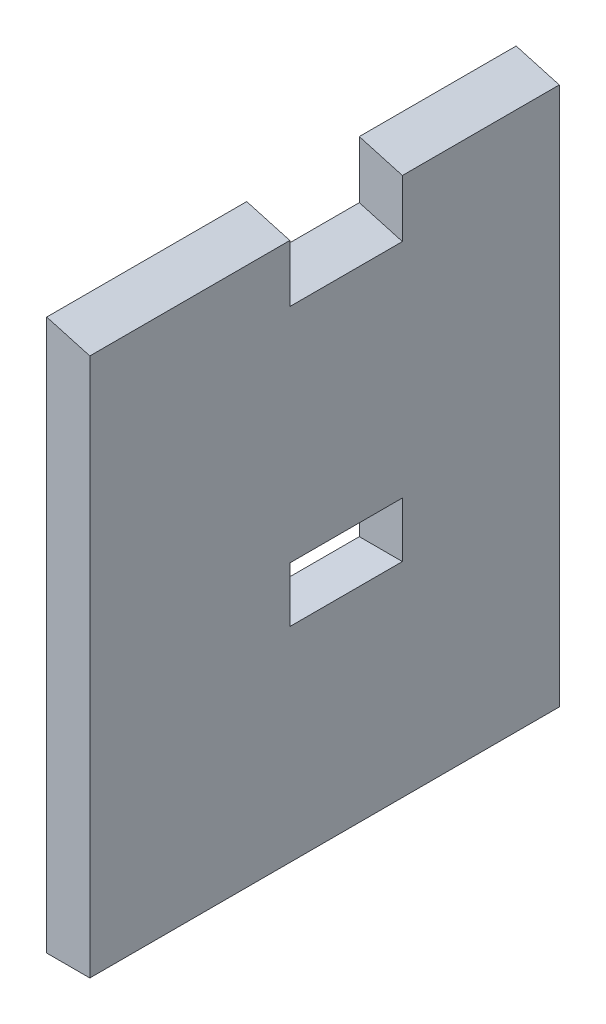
ISO-10303-21;
HEADER;
FILE_DESCRIPTION(('STEP AP214'),'2;1');
FILE_NAME('part.step','',(''),(''),'','','');
FILE_SCHEMA(('AUTOMOTIVE_DESIGN { 1 0 10303 214 1 1 1 1 }'));
ENDSEC;
DATA;
#1=APPLICATION_CONTEXT('core data for automotive mechanical design processes');
#2=APPLICATION_PROTOCOL_DEFINITION('international standard','automotive_design',2000,#1);
#3=PRODUCT_CONTEXT('',#1,'mechanical');
#4=PRODUCT('Part','Part','',(#3));
#5=PRODUCT_RELATED_PRODUCT_CATEGORY('part','',(#4));
#6=PRODUCT_DEFINITION_FORMATION('','',#4);
#7=PRODUCT_DEFINITION_CONTEXT('part definition',#1,'design');
#8=PRODUCT_DEFINITION('design','',#6,#7);
#9=PRODUCT_DEFINITION_SHAPE('','',#8);
#10=(LENGTH_UNIT() NAMED_UNIT(*) SI_UNIT(.MILLI.,.METRE.));
#11=(NAMED_UNIT(*) PLANE_ANGLE_UNIT() SI_UNIT($,.RADIAN.));
#12=(NAMED_UNIT(*) SI_UNIT($,.STERADIAN.) SOLID_ANGLE_UNIT());
#13=UNCERTAINTY_MEASURE_WITH_UNIT(LENGTH_MEASURE(1.E-05),#10,'distance_accuracy_value','');
#14=(GEOMETRIC_REPRESENTATION_CONTEXT(3) GLOBAL_UNCERTAINTY_ASSIGNED_CONTEXT((#13)) GLOBAL_UNIT_ASSIGNED_CONTEXT((#10,
#11,#12)) REPRESENTATION_CONTEXT('',''));
#15=CARTESIAN_POINT('',(0.,0.,0.));
#16=DIRECTION('',(0.,0.,1.));
#17=DIRECTION('',(1.,0.,0.));
#18=AXIS2_PLACEMENT_3D('',#15,#16,#17);
#19=CARTESIAN_POINT('',(29.3431100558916,104.202718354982,196.));
#20=DIRECTION('',(0.271054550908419,0.962563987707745,0.));
#21=DIRECTION('',(-0.962563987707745,0.271054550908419,0.));
#22=AXIS2_PLACEMENT_3D('',#19,#20,#21);
#23=PLANE('',#22);
#24=DIRECTION('',(0.962563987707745,-0.271054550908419,0.));
#25=VECTOR('',#24,1.);
#26=CARTESIAN_POINT('',(-22.7816678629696,118.880868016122,112.5));
#27=LINE('',#26,#25);
#28=CARTESIAN_POINT('',(-9.00000000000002,115.,112.5));
#29=VERTEX_POINT('',#28);
#30=CARTESIAN_POINT('',(9.,109.931264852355,112.5));
#31=VERTEX_POINT('',#30);
#32=EDGE_CURVE('E141',#29,#31,#27,.T.);
#33=ORIENTED_EDGE('',*,*,#32,.F.);
#34=DIRECTION('',(0.,0.,-1.));
#35=VECTOR('',#34,1.);
#36=CARTESIAN_POINT('',(-9.00000000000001,115.,196.));
#37=LINE('',#36,#35);
#38=CARTESIAN_POINT('',(-9.00000000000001,115.,196.));
#39=VERTEX_POINT('',#38);
#40=EDGE_CURVE('E149',#39,#29,#37,.T.);
#41=ORIENTED_EDGE('',*,*,#40,.F.);
#42=DIRECTION('',(0.962563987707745,-0.271054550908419,0.));
#43=VECTOR('',#42,1.);
#44=CARTESIAN_POINT('',(29.3431100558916,104.202718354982,196.));
#45=LINE('',#44,#43);
#46=CARTESIAN_POINT('',(8.99999999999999,109.931264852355,196.));
#47=VERTEX_POINT('',#46);
#48=EDGE_CURVE('E208',#39,#47,#45,.T.);
#49=ORIENTED_EDGE('',*,*,#48,.T.);
#50=DIRECTION('',(0.,0.,-1.));
#51=VECTOR('',#50,1.);
#52=CARTESIAN_POINT('',(8.99999999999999,109.931264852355,196.));
#53=LINE('',#52,#51);
#54=EDGE_CURVE('E148',#47,#31,#53,.T.);
#55=ORIENTED_EDGE('',*,*,#54,.T.);
#56=EDGE_LOOP('',(#33,#41,#49,#55));
#57=FACE_BOUND('',#56,.T.);
#58=ADVANCED_FACE('F35',(#57),#23,.T.);
#59=CARTESIAN_POINT('',(9.,0.,196.));
#60=DIRECTION('',(1.,0.,0.));
#61=DIRECTION('',(0.,1.,0.));
#62=AXIS2_PLACEMENT_3D('',#59,#60,#61);
#63=PLANE('',#62);
#64=DIRECTION('',(0.,-1.,0.));
#65=VECTOR('',#64,1.);
#66=CARTESIAN_POINT('',(9.,0.,112.5));
#67=LINE('',#66,#65);
#68=CARTESIAN_POINT('',(8.99999999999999,86.0367494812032,112.5));
#69=VERTEX_POINT('',#68);
#70=EDGE_CURVE('E131',#31,#69,#67,.T.);
#71=ORIENTED_EDGE('',*,*,#70,.F.);
#72=ORIENTED_EDGE('',*,*,#54,.F.);
#73=DIRECTION('',(0.,-1.,0.));
#74=VECTOR('',#73,1.);
#75=CARTESIAN_POINT('',(9.,0.,196.));
#76=LINE('',#75,#74);
#77=CARTESIAN_POINT('',(9.00000000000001,-115.,196.));
#78=VERTEX_POINT('',#77);
#79=EDGE_CURVE('E205',#47,#78,#76,.T.);
#80=ORIENTED_EDGE('',*,*,#79,.T.);
#81=DIRECTION('',(0.,0.,-1.));
#82=VECTOR('',#81,1.);
#83=CARTESIAN_POINT('',(9.00000000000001,-115.,196.));
#84=LINE('',#83,#82);
#85=CARTESIAN_POINT('',(9.00000000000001,-115.,0.));
#86=VERTEX_POINT('',#85);
#87=EDGE_CURVE('E216',#78,#86,#84,.T.);
#88=ORIENTED_EDGE('',*,*,#87,.T.);
#89=DIRECTION('',(0.,-1.,0.));
#90=VECTOR('',#89,1.);
#91=CARTESIAN_POINT('',(9.,0.,0.));
#92=LINE('',#91,#90);
#93=CARTESIAN_POINT('',(8.99999999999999,109.931264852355,0.));
#94=VERTEX_POINT('',#93);
#95=EDGE_CURVE('E146',#94,#86,#92,.T.);
#96=ORIENTED_EDGE('',*,*,#95,.F.);
#97=CARTESIAN_POINT('',(9.,109.931264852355,65.5));
#98=VERTEX_POINT('',#97);
#99=EDGE_CURVE('E138',#98,#94,#53,.T.);
#100=ORIENTED_EDGE('',*,*,#99,.F.);
#101=DIRECTION('',(0.,1.,0.));
#102=VECTOR('',#101,1.);
#103=CARTESIAN_POINT('',(9.,0.,65.5));
#104=LINE('',#103,#102);
#105=CARTESIAN_POINT('',(8.99999999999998,86.0367494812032,65.5));
#106=VERTEX_POINT('',#105);
#107=EDGE_CURVE('E123',#106,#98,#104,.T.);
#108=ORIENTED_EDGE('',*,*,#107,.F.);
#109=DIRECTION('',(0.,0.,1.));
#110=VECTOR('',#109,1.);
#111=CARTESIAN_POINT('',(8.99999999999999,86.0367494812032,196.));
#112=LINE('',#111,#110);
#113=EDGE_CURVE('E132',#106,#69,#112,.T.);
#114=ORIENTED_EDGE('',*,*,#113,.T.);
#115=EDGE_LOOP('',(#71,#72,#80,#88,#96,#100,#108,#114));
#116=FACE_BOUND('',#115,.T.);
#117=DIRECTION('',(0.,1.,0.));
#118=VECTOR('',#117,1.);
#119=CARTESIAN_POINT('',(9.,-6.66873514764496,65.5));
#120=LINE('',#119,#118);
#121=CARTESIAN_POINT('',(9.00000000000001,-29.668735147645,65.5));
#122=VERTEX_POINT('',#121);
#123=CARTESIAN_POINT('',(9.,-6.66873514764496,65.5));
#124=VERTEX_POINT('',#123);
#125=EDGE_CURVE('E58',#122,#124,#120,.T.);
#126=ORIENTED_EDGE('',*,*,#125,.F.);
#127=DIRECTION('',(0.,0.,-1.));
#128=VECTOR('',#127,1.);
#129=CARTESIAN_POINT('',(9.00000000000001,-29.668735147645,112.5));
#130=LINE('',#129,#128);
#131=CARTESIAN_POINT('',(9.00000000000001,-29.668735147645,112.5));
#132=VERTEX_POINT('',#131);
#133=EDGE_CURVE('E179',#132,#122,#130,.T.);
#134=ORIENTED_EDGE('',*,*,#133,.F.);
#135=DIRECTION('',(0.,-1.,0.));
#136=VECTOR('',#135,1.);
#137=CARTESIAN_POINT('',(9.,-6.66873514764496,112.5));
#138=LINE('',#137,#136);
#139=CARTESIAN_POINT('',(9.,-6.66873514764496,112.5));
#140=VERTEX_POINT('',#139);
#141=EDGE_CURVE('E193',#140,#132,#138,.T.);
#142=ORIENTED_EDGE('',*,*,#141,.F.);
#143=DIRECTION('',(0.,0.,1.));
#144=VECTOR('',#143,1.);
#145=CARTESIAN_POINT('',(9.,-6.66873514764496,112.5));
#146=LINE('',#145,#144);
#147=EDGE_CURVE('E190',#124,#140,#146,.T.);
#148=ORIENTED_EDGE('',*,*,#147,.F.);
#149=EDGE_LOOP('',(#126,#134,#142,#148));
#150=FACE_BOUND('',#149,.T.);
#151=ADVANCED_FACE('F37',(#116,#150),#63,.T.);
#152=DIRECTION('',(-0.962563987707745,0.271054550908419,0.));
#153=VECTOR('',#152,1.);
#154=CARTESIAN_POINT('',(-22.7816678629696,118.880868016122,65.5));
#155=LINE('',#154,#153);
#156=CARTESIAN_POINT('',(-9.00000000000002,115.,65.5));
#157=VERTEX_POINT('',#156);
#158=EDGE_CURVE('E126',#98,#157,#155,.T.);
#159=ORIENTED_EDGE('',*,*,#158,.F.);
#160=ORIENTED_EDGE('',*,*,#99,.T.);
#161=DIRECTION('',(0.962563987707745,-0.271054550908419,0.));
#162=VECTOR('',#161,1.);
#163=CARTESIAN_POINT('',(29.3431100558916,104.202718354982,0.));
#164=LINE('',#163,#162);
#165=CARTESIAN_POINT('',(-9.00000000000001,115.,0.));
#166=VERTEX_POINT('',#165);
#167=EDGE_CURVE('E218',#166,#94,#164,.T.);
#168=ORIENTED_EDGE('',*,*,#167,.F.);
#169=EDGE_CURVE('E140',#157,#166,#37,.T.);
#170=ORIENTED_EDGE('',*,*,#169,.F.);
#171=EDGE_LOOP('',(#159,#160,#168,#170));
#172=FACE_BOUND('',#171,.T.);
#173=ADVANCED_FACE('F136',(#172),#23,.T.);
#174=CARTESIAN_POINT('',(-9.,0.,196.));
#175=DIRECTION('',(1.,0.,0.));
#176=DIRECTION('',(0.,1.,0.));
#177=AXIS2_PLACEMENT_3D('',#174,#175,#176);
#178=PLANE('',#177);
#179=ORIENTED_EDGE('',*,*,#40,.T.);
#180=DIRECTION('',(0.,-1.,0.));
#181=VECTOR('',#180,1.);
#182=CARTESIAN_POINT('',(-9.,0.,112.5));
#183=LINE('',#182,#181);
#184=CARTESIAN_POINT('',(-9.00000000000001,91.1054846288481,112.5));
#185=VERTEX_POINT('',#184);
#186=EDGE_CURVE('E11',#29,#185,#183,.T.);
#187=ORIENTED_EDGE('',*,*,#186,.T.);
#188=DIRECTION('',(0.,0.,1.));
#189=VECTOR('',#188,1.);
#190=CARTESIAN_POINT('',(-9.00000000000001,91.1054846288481,196.));
#191=LINE('',#190,#189);
#192=CARTESIAN_POINT('',(-9.00000000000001,91.1054846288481,65.5));
#193=VERTEX_POINT('',#192);
#194=EDGE_CURVE('E152',#193,#185,#191,.T.);
#195=ORIENTED_EDGE('',*,*,#194,.F.);
#196=DIRECTION('',(0.,1.,0.));
#197=VECTOR('',#196,1.);
#198=CARTESIAN_POINT('',(-9.,0.,65.5));
#199=LINE('',#198,#197);
#200=EDGE_CURVE('E43',#193,#157,#199,.T.);
#201=ORIENTED_EDGE('',*,*,#200,.T.);
#202=ORIENTED_EDGE('',*,*,#169,.T.);
#203=DIRECTION('',(0.,-1.,0.));
#204=VECTOR('',#203,1.);
#205=CARTESIAN_POINT('',(-9.,0.,0.));
#206=LINE('',#205,#204);
#207=CARTESIAN_POINT('',(-8.99999999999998,-115.,0.));
#208=VERTEX_POINT('',#207);
#209=EDGE_CURVE('E220',#166,#208,#206,.T.);
#210=ORIENTED_EDGE('',*,*,#209,.T.);
#211=DIRECTION('',(0.,0.,-1.));
#212=VECTOR('',#211,1.);
#213=CARTESIAN_POINT('',(-8.99999999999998,-115.,196.));
#214=LINE('',#213,#212);
#215=CARTESIAN_POINT('',(-8.99999999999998,-115.,196.));
#216=VERTEX_POINT('',#215);
#217=EDGE_CURVE('E224',#216,#208,#214,.T.);
#218=ORIENTED_EDGE('',*,*,#217,.F.);
#219=DIRECTION('',(0.,-1.,0.));
#220=VECTOR('',#219,1.);
#221=CARTESIAN_POINT('',(-9.,0.,196.));
#222=LINE('',#221,#220);
#223=EDGE_CURVE('E212',#39,#216,#222,.T.);
#224=ORIENTED_EDGE('',*,*,#223,.F.);
#225=EDGE_LOOP('',(#179,#187,#195,#201,#202,#210,#218,#224));
#226=FACE_BOUND('',#225,.T.);
#227=DIRECTION('',(0.,0.,-1.));
#228=VECTOR('',#227,1.);
#229=CARTESIAN_POINT('',(-9.00000000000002,-29.668735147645,112.5));
#230=LINE('',#229,#228);
#231=CARTESIAN_POINT('',(-9.00000000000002,-29.668735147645,112.5));
#232=VERTEX_POINT('',#231);
#233=CARTESIAN_POINT('',(-9.00000000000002,-29.668735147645,65.5));
#234=VERTEX_POINT('',#233);
#235=EDGE_CURVE('E185',#232,#234,#230,.T.);
#236=ORIENTED_EDGE('',*,*,#235,.T.);
#237=DIRECTION('',(0.,1.,0.));
#238=VECTOR('',#237,1.);
#239=CARTESIAN_POINT('',(-9.00000000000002,-6.66873514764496,65.5));
#240=LINE('',#239,#238);
#241=CARTESIAN_POINT('',(-9.00000000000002,-6.66873514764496,65.5));
#242=VERTEX_POINT('',#241);
#243=EDGE_CURVE('E175',#234,#242,#240,.T.);
#244=ORIENTED_EDGE('',*,*,#243,.T.);
#245=DIRECTION('',(0.,0.,1.));
#246=VECTOR('',#245,1.);
#247=CARTESIAN_POINT('',(-9.00000000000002,-6.66873514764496,112.5));
#248=LINE('',#247,#246);
#249=CARTESIAN_POINT('',(-9.,-6.66873514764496,112.5));
#250=VERTEX_POINT('',#249);
#251=EDGE_CURVE('E178',#242,#250,#248,.T.);
#252=ORIENTED_EDGE('',*,*,#251,.T.);
#253=DIRECTION('',(0.,-1.,0.));
#254=VECTOR('',#253,1.);
#255=CARTESIAN_POINT('',(-9.00000000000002,-6.66873514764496,112.5));
#256=LINE('',#255,#254);
#257=EDGE_CURVE('E182',#250,#232,#256,.T.);
#258=ORIENTED_EDGE('',*,*,#257,.T.);
#259=EDGE_LOOP('',(#236,#244,#252,#258));
#260=FACE_BOUND('',#259,.T.);
#261=ADVANCED_FACE('F159',(#226,#260),#178,.F.);
#262=CARTESIAN_POINT('',(0.,-115.,196.));
#263=DIRECTION('',(0.,1.,0.));
#264=DIRECTION('',(0.,0.,1.));
#265=AXIS2_PLACEMENT_3D('',#262,#263,#264);
#266=PLANE('',#265);
#267=DIRECTION('',(1.,0.,0.));
#268=VECTOR('',#267,1.);
#269=CARTESIAN_POINT('',(0.,-115.,0.));
#270=LINE('',#269,#268);
#271=EDGE_CURVE('E209',#208,#86,#270,.T.);
#272=ORIENTED_EDGE('',*,*,#271,.T.);
#273=ORIENTED_EDGE('',*,*,#87,.F.);
#274=DIRECTION('',(1.,0.,0.));
#275=VECTOR('',#274,1.);
#276=CARTESIAN_POINT('',(0.,-115.,196.));
#277=LINE('',#276,#275);
#278=EDGE_CURVE('E214',#216,#78,#277,.T.);
#279=ORIENTED_EDGE('',*,*,#278,.F.);
#280=ORIENTED_EDGE('',*,*,#217,.T.);
#281=EDGE_LOOP('',(#272,#273,#279,#280));
#282=FACE_BOUND('',#281,.T.);
#283=ADVANCED_FACE('F230',(#282),#266,.F.);
#284=CARTESIAN_POINT('',(0.,0.,196.));
#285=DIRECTION('',(0.,0.,1.));
#286=DIRECTION('',(1.,0.,0.));
#287=AXIS2_PLACEMENT_3D('',#284,#285,#286);
#288=PLANE('',#287);
#289=ORIENTED_EDGE('',*,*,#79,.F.);
#290=ORIENTED_EDGE('',*,*,#48,.F.);
#291=ORIENTED_EDGE('',*,*,#223,.T.);
#292=ORIENTED_EDGE('',*,*,#278,.T.);
#293=EDGE_LOOP('',(#289,#290,#291,#292));
#294=FACE_BOUND('',#293,.T.);
#295=ADVANCED_FACE('F237',(#294),#288,.T.);
#296=CARTESIAN_POINT('',(0.,0.,0.));
#297=DIRECTION('',(0.,0.,1.));
#298=DIRECTION('',(1.,0.,0.));
#299=AXIS2_PLACEMENT_3D('',#296,#297,#298);
#300=PLANE('',#299);
#301=ORIENTED_EDGE('',*,*,#95,.T.);
#302=ORIENTED_EDGE('',*,*,#271,.F.);
#303=ORIENTED_EDGE('',*,*,#209,.F.);
#304=ORIENTED_EDGE('',*,*,#167,.T.);
#305=EDGE_LOOP('',(#301,#302,#303,#304));
#306=FACE_BOUND('',#305,.T.);
#307=ADVANCED_FACE('F234',(#306),#300,.F.);
#308=CARTESIAN_POINT('',(-9.00000000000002,-6.66873514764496,65.5));
#309=DIRECTION('',(0.,0.,-1.));
#310=DIRECTION('',(-1.,0.,0.));
#311=AXIS2_PLACEMENT_3D('',#308,#309,#310);
#312=PLANE('',#311);
#313=ORIENTED_EDGE('',*,*,#125,.T.);
#314=DIRECTION('',(1.,0.,0.));
#315=VECTOR('',#314,1.);
#316=CARTESIAN_POINT('',(-9.00000000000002,-6.66873514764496,65.5));
#317=LINE('',#316,#315);
#318=EDGE_CURVE('E188',#242,#124,#317,.T.);
#319=ORIENTED_EDGE('',*,*,#318,.F.);
#320=ORIENTED_EDGE('',*,*,#243,.F.);
#321=DIRECTION('',(1.,0.,0.));
#322=VECTOR('',#321,1.);
#323=CARTESIAN_POINT('',(-9.00000000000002,-29.668735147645,65.5));
#324=LINE('',#323,#322);
#325=EDGE_CURVE('E198',#234,#122,#324,.T.);
#326=ORIENTED_EDGE('',*,*,#325,.T.);
#327=EDGE_LOOP('',(#313,#319,#320,#326));
#328=FACE_BOUND('',#327,.T.);
#329=ADVANCED_FACE('F236',(#328),#312,.F.);
#330=CARTESIAN_POINT('',(-9.00000000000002,-29.668735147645,112.5));
#331=DIRECTION('',(0.,-1.,0.));
#332=DIRECTION('',(1.,0.,0.));
#333=AXIS2_PLACEMENT_3D('',#330,#331,#332);
#334=PLANE('',#333);
#335=ORIENTED_EDGE('',*,*,#133,.T.);
#336=ORIENTED_EDGE('',*,*,#325,.F.);
#337=ORIENTED_EDGE('',*,*,#235,.F.);
#338=DIRECTION('',(1.,0.,0.));
#339=VECTOR('',#338,1.);
#340=CARTESIAN_POINT('',(-9.00000000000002,-29.668735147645,112.5));
#341=LINE('',#340,#339);
#342=EDGE_CURVE('E200',#232,#132,#341,.T.);
#343=ORIENTED_EDGE('',*,*,#342,.T.);
#344=EDGE_LOOP('',(#335,#336,#337,#343));
#345=FACE_BOUND('',#344,.T.);
#346=ADVANCED_FACE('F243',(#345),#334,.F.);
#347=CARTESIAN_POINT('',(-9.00000000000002,-6.66873514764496,112.5));
#348=DIRECTION('',(0.,0.,1.));
#349=DIRECTION('',(1.,0.,0.));
#350=AXIS2_PLACEMENT_3D('',#347,#348,#349);
#351=PLANE('',#350);
#352=ORIENTED_EDGE('',*,*,#141,.T.);
#353=ORIENTED_EDGE('',*,*,#342,.F.);
#354=ORIENTED_EDGE('',*,*,#257,.F.);
#355=DIRECTION('',(1.,0.,0.));
#356=VECTOR('',#355,1.);
#357=CARTESIAN_POINT('',(-9.00000000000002,-6.66873514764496,112.5));
#358=LINE('',#357,#356);
#359=EDGE_CURVE('E202',#250,#140,#358,.T.);
#360=ORIENTED_EDGE('',*,*,#359,.T.);
#361=EDGE_LOOP('',(#352,#353,#354,#360));
#362=FACE_BOUND('',#361,.T.);
#363=ADVANCED_FACE('F286',(#362),#351,.F.);
#364=CARTESIAN_POINT('',(-9.00000000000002,-6.66873514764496,112.5));
#365=DIRECTION('',(0.,1.,0.));
#366=DIRECTION('',(-1.,0.,0.));
#367=AXIS2_PLACEMENT_3D('',#364,#365,#366);
#368=PLANE('',#367);
#369=ORIENTED_EDGE('',*,*,#147,.T.);
#370=ORIENTED_EDGE('',*,*,#359,.F.);
#371=ORIENTED_EDGE('',*,*,#251,.F.);
#372=ORIENTED_EDGE('',*,*,#318,.T.);
#373=EDGE_LOOP('',(#369,#370,#371,#372));
#374=FACE_BOUND('',#373,.T.);
#375=ADVANCED_FACE('F296',(#374),#368,.F.);
#376=CARTESIAN_POINT('',(-29.0159225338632,96.7418962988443,112.5));
#377=DIRECTION('',(0.,0.,1.));
#378=DIRECTION('',(1.,0.,0.));
#379=AXIS2_PLACEMENT_3D('',#376,#377,#378);
#380=PLANE('',#379);
#381=ORIENTED_EDGE('',*,*,#70,.T.);
#382=DIRECTION('',(0.962563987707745,-0.271054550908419,0.));
#383=VECTOR('',#382,1.);
#384=CARTESIAN_POINT('',(-29.0159225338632,96.7418962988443,112.5));
#385=LINE('',#384,#383);
#386=EDGE_CURVE('E165',#185,#69,#385,.T.);
#387=ORIENTED_EDGE('',*,*,#386,.F.);
#388=ORIENTED_EDGE('',*,*,#186,.F.);
#389=ORIENTED_EDGE('',*,*,#32,.T.);
#390=EDGE_LOOP('',(#381,#387,#388,#389));
#391=FACE_BOUND('',#390,.T.);
#392=ADVANCED_FACE('F167',(#391),#380,.F.);
#393=CARTESIAN_POINT('',(-29.0159225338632,96.7418962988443,65.5));
#394=DIRECTION('',(0.,0.,-1.));
#395=DIRECTION('',(-1.,0.,0.));
#396=AXIS2_PLACEMENT_3D('',#393,#394,#395);
#397=PLANE('',#396);
#398=ORIENTED_EDGE('',*,*,#107,.T.);
#399=ORIENTED_EDGE('',*,*,#158,.T.);
#400=ORIENTED_EDGE('',*,*,#200,.F.);
#401=DIRECTION('',(-0.962563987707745,0.271054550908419,0.));
#402=VECTOR('',#401,1.);
#403=CARTESIAN_POINT('',(-29.0159225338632,96.7418962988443,65.5));
#404=LINE('',#403,#402);
#405=EDGE_CURVE('E50',#106,#193,#404,.T.);
#406=ORIENTED_EDGE('',*,*,#405,.F.);
#407=EDGE_LOOP('',(#398,#399,#400,#406));
#408=FACE_BOUND('',#407,.T.);
#409=ADVANCED_FACE('F125',(#408),#397,.F.);
#410=CARTESIAN_POINT('',(23.108855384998,82.0637466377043,0.));
#411=DIRECTION('',(0.271054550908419,0.962563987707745,0.));
#412=DIRECTION('',(-0.962563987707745,0.271054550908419,0.));
#413=AXIS2_PLACEMENT_3D('',#410,#411,#412);
#414=PLANE('',#413);
#415=ORIENTED_EDGE('',*,*,#405,.T.);
#416=ORIENTED_EDGE('',*,*,#194,.T.);
#417=ORIENTED_EDGE('',*,*,#386,.T.);
#418=ORIENTED_EDGE('',*,*,#113,.F.);
#419=EDGE_LOOP('',(#415,#416,#417,#418));
#420=FACE_BOUND('',#419,.T.);
#421=ADVANCED_FACE('F164',(#420),#414,.T.);
#422=CLOSED_SHELL('',(#58,#151,#173,#261,#283,#295,#307,#329,#346,#363,#375,#392,#409,#421));
#423=MANIFOLD_SOLID_BREP('B2',#422);
#424=ADVANCED_BREP_SHAPE_REPRESENTATION('',(#18,#423),#14);
#425=SHAPE_DEFINITION_REPRESENTATION(#9,#424);
ENDSEC;
END-ISO-10303-21;
